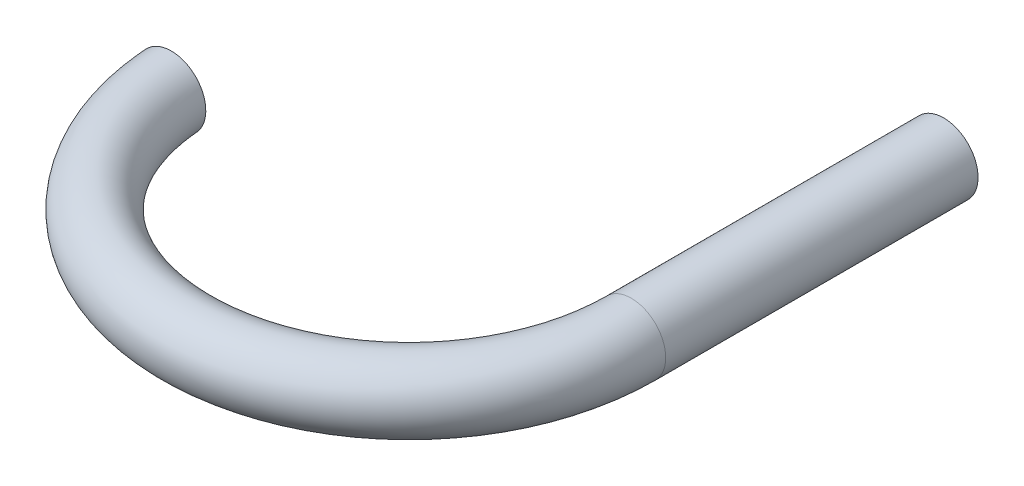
ISO-10303-21;
HEADER;
FILE_DESCRIPTION(('STEP AP214'),'2;1');
FILE_NAME('part.step','',(''),(''),'','','');
FILE_SCHEMA(('AUTOMOTIVE_DESIGN { 1 0 10303 214 1 1 1 1 }'));
ENDSEC;
DATA;
#1=APPLICATION_CONTEXT('core data for automotive mechanical design processes');
#2=APPLICATION_PROTOCOL_DEFINITION('international standard','automotive_design',2000,#1);
#3=PRODUCT_CONTEXT('',#1,'mechanical');
#4=PRODUCT('Part','Part','',(#3));
#5=PRODUCT_RELATED_PRODUCT_CATEGORY('part','',(#4));
#6=PRODUCT_DEFINITION_FORMATION('','',#4);
#7=PRODUCT_DEFINITION_CONTEXT('part definition',#1,'design');
#8=PRODUCT_DEFINITION('design','',#6,#7);
#9=PRODUCT_DEFINITION_SHAPE('','',#8);
#10=(LENGTH_UNIT() NAMED_UNIT(*) SI_UNIT(.MILLI.,.METRE.));
#11=(NAMED_UNIT(*) PLANE_ANGLE_UNIT() SI_UNIT($,.RADIAN.));
#12=(NAMED_UNIT(*) SI_UNIT($,.STERADIAN.) SOLID_ANGLE_UNIT());
#13=UNCERTAINTY_MEASURE_WITH_UNIT(LENGTH_MEASURE(1.E-05),#10,'distance_accuracy_value','');
#14=(GEOMETRIC_REPRESENTATION_CONTEXT(3) GLOBAL_UNCERTAINTY_ASSIGNED_CONTEXT((#13)) GLOBAL_UNIT_ASSIGNED_CONTEXT((#10,
#11,#12)) REPRESENTATION_CONTEXT('',''));
#15=CARTESIAN_POINT('',(0.,0.,0.));
#16=DIRECTION('',(0.,0.,1.));
#17=DIRECTION('',(1.,0.,0.));
#18=AXIS2_PLACEMENT_3D('',#15,#16,#17);
#19=CARTESIAN_POINT('',(-298.225813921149,72.1037781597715,15.));
#20=DIRECTION('',(0.,0.,-1.));
#21=DIRECTION('',(-1.,0.,0.));
#22=AXIS2_PLACEMENT_3D('',#19,#20,#21);
#23=PLANE('',#22);
#24=CARTESIAN_POINT('',(-232.153031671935,-23.3197501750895,15.));
#25=CARTESIAN_POINT('',(-232.808584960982,-22.6847204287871,15.));
#26=CARTESIAN_POINT('',(-233.437312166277,-22.02215820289,15.));
#27=CARTESIAN_POINT('',(-234.637011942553,-20.6462819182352,15.));
#28=CARTESIAN_POINT('',(-235.207969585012,-19.9329548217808,15.));
#29=CARTESIAN_POINT('',(-236.288393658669,-18.459983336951,15.));
#30=CARTESIAN_POINT('',(-236.797792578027,-17.7002894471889,15.));
#31=CARTESIAN_POINT('',(-237.750708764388,-16.1407115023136,15.));
#32=CARTESIAN_POINT('',(-238.194230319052,-15.340830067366,15.));
#33=CARTESIAN_POINT('',(-239.012085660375,-13.7068298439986,15.));
#34=CARTESIAN_POINT('',(-239.386445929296,-12.8727243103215,15.));
#35=CARTESIAN_POINT('',(-240.063506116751,-11.1759029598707,15.));
#36=CARTESIAN_POINT('',(-240.366204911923,-10.313186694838,15.));
#37=CARTESIAN_POINT('',(-240.89769071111,-8.56551662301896,15.));
#38=CARTESIAN_POINT('',(-241.126496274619,-7.68056846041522,15.));
#39=CARTESIAN_POINT('',(-241.50865307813,-5.89453085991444,15.));
#40=CARTESIAN_POINT('',(-241.662004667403,-4.99344149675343,15.));
#41=CARTESIAN_POINT('',(-241.892045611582,-3.18237161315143,15.));
#42=CARTESIAN_POINT('',(-241.968805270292,-2.27240002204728,15.));
#43=CARTESIAN_POINT('',(-242.045357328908,-0.449224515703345,15.));
#44=CARTESIAN_POINT('',(-242.045149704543,0.463979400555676,15.));
#45=CARTESIAN_POINT('',(-241.967767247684,2.28715141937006,15.));
#46=CARTESIAN_POINT('',(-241.890589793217,3.19711941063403,15.));
#47=CARTESIAN_POINT('',(-241.659818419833,5.0073131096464,15.));
#48=CARTESIAN_POINT('',(-241.506224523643,5.90753882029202,15.));
#49=CARTESIAN_POINT('',(-241.1238143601,7.69142271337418,15.));
#50=CARTESIAN_POINT('',(-240.895033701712,8.57508852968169,15.));
#51=CARTESIAN_POINT('',(-240.363871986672,10.3200150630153,15.));
#52=CARTESIAN_POINT('',(-240.061490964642,11.1812757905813,15.));
#53=CARTESIAN_POINT('',(-239.385296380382,12.8752812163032,15.));
#54=CARTESIAN_POINT('',(-239.011482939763,13.7080259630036,15.));
#55=CARTESIAN_POINT('',(-238.195099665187,15.3391012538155,15.));
#56=CARTESIAN_POINT('',(-237.752529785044,16.1374317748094,15.));
#57=CARTESIAN_POINT('',(-236.801491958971,17.6945326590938,15.));
#58=CARTESIAN_POINT('',(-236.292981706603,18.4532771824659,15.));
#59=CARTESIAN_POINT('',(-235.213921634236,19.9252867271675,15.));
#60=CARTESIAN_POINT('',(-234.643371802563,20.638551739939,15.));
#61=CARTESIAN_POINT('',(-233.4443044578,22.0145706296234,15.));
#62=CARTESIAN_POINT('',(-232.815786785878,22.6773243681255,15.));
#63=CARTESIAN_POINT('',(-231.505264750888,23.9476521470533,15.));
#64=CARTESIAN_POINT('',(-230.823260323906,24.5552261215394,15.));
#65=CARTESIAN_POINT('',(-229.40949604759,25.711843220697,15.));
#66=CARTESIAN_POINT('',(-228.677658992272,26.2607919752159,15.));
#67=CARTESIAN_POINT('',(-227.170410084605,27.2951942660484,15.));
#68=CARTESIAN_POINT('',(-226.394998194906,27.7806477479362,15.));
#69=CARTESIAN_POINT('',(-224.806106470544,28.6846612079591,15.));
#70=CARTESIAN_POINT('',(-223.992626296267,29.103220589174,15.));
#71=CARTESIAN_POINT('',(-222.333377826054,29.8705165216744,15.));
#72=CARTESIAN_POINT('',(-221.48760948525,30.2192529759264,15.));
#73=CARTESIAN_POINT('',(-219.76797021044,30.8451317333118,15.));
#74=CARTESIAN_POINT('',(-218.894043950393,31.1221220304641,15.));
#75=CARTESIAN_POINT('',(-217.12599142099,31.6016175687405,15.));
#76=CARTESIAN_POINT('',(-216.231865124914,31.8041227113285,15.));
#77=CARTESIAN_POINT('',(-214.429745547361,32.1332460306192,15.));
#78=CARTESIAN_POINT('',(-213.521752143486,32.2598635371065,15.));
#79=CARTESIAN_POINT('',(-211.698336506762,32.436339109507,15.));
#80=CARTESIAN_POINT('',(-210.782914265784,32.4861970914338,15.));
#81=CARTESIAN_POINT('',(-208.949359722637,32.5088424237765,15.));
#82=CARTESIAN_POINT('',(-208.031225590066,32.4814817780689,15.));
#83=CARTESIAN_POINT('',(-206.200517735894,32.3495789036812,15.));
#84=CARTESIAN_POINT('',(-205.287944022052,32.2450365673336,15.));
#85=CARTESIAN_POINT('',(-203.474826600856,31.9595155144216,15.));
#86=CARTESIAN_POINT('',(-202.574282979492,31.7785362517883,15.));
#87=CARTESIAN_POINT('',(-200.791624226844,31.3414210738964,15.));
#88=CARTESIAN_POINT('',(-199.90950909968,31.085285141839,15.));
#89=CARTESIAN_POINT('',(-198.169224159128,30.4994088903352,15.));
#90=CARTESIAN_POINT('',(-197.31107558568,30.1696054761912,15.));
#91=CARTESIAN_POINT('',(-195.625627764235,29.4388434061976,15.));
#92=CARTESIAN_POINT('',(-194.798328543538,29.0378846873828,15.));
#93=CARTESIAN_POINT('',(-193.180484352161,28.1676362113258,15.));
#94=CARTESIAN_POINT('',(-192.389939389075,27.6983464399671,15.));
#95=CARTESIAN_POINT('',(-190.851260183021,26.6947436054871,15.));
#96=CARTESIAN_POINT('',(-190.103125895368,26.1604306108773,15.));
#97=CARTESIAN_POINT('',(-188.65529623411,25.0310676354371,15.));
#98=CARTESIAN_POINT('',(-187.955557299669,24.4360735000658,15.));
#99=CARTESIAN_POINT('',(-186.608797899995,23.1891434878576,15.));
#100=CARTESIAN_POINT('',(-185.961777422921,22.537207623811,15.));
#101=CARTESIAN_POINT('',(-184.725127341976,21.1810131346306,15.));
#102=CARTESIAN_POINT('',(-184.13549721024,20.4767549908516,15.));
#103=CARTESIAN_POINT('',(-183.017891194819,19.0209079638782,15.));
#104=CARTESIAN_POINT('',(-182.489915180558,18.2693191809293,15.));
#105=CARTESIAN_POINT('',(-181.500773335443,16.7262160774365,15.));
#106=CARTESIAN_POINT('',(-181.039433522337,15.9348132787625,15.));
#107=CARTESIAN_POINT('',(-180.185247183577,14.3158681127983,15.));
#108=CARTESIAN_POINT('',(-179.792400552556,13.4883258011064,15.));
#109=CARTESIAN_POINT('',(-179.07806907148,11.8030080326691,15.));
#110=CARTESIAN_POINT('',(-178.756583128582,10.9452330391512,15.));
#111=CARTESIAN_POINT('',(-178.187316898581,9.20556429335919,15.));
#112=CARTESIAN_POINT('',(-177.939536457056,8.32367059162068,15.));
#113=CARTESIAN_POINT('',(-177.520173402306,6.54494286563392,15.));
#114=CARTESIAN_POINT('',(-177.34834842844,5.64816597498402,15.));
#115=CARTESIAN_POINT('',(-177.080990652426,3.84331135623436,15.));
#116=CARTESIAN_POINT('',(-176.985457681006,2.93523365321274,15.));
#117=CARTESIAN_POINT('',(-176.871383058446,1.11426536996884,15.));
#118=CARTESIAN_POINT('',(-176.852840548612,0.201374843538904,15.));
#119=CARTESIAN_POINT('',(-176.892880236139,-1.6227130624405,15.));
#120=CARTESIAN_POINT('',(-176.951462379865,-2.533910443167,15.));
#121=CARTESIAN_POINT('',(-177.145142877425,-4.34642981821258,15.));
#122=CARTESIAN_POINT('',(-177.28009951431,-5.24776696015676,15.));
#123=CARTESIAN_POINT('',(-177.625441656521,-7.03587155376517,15.));
#124=CARTESIAN_POINT('',(-177.835827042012,-7.92263902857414,15.));
#125=CARTESIAN_POINT('',(-178.330497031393,-9.6753142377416,15.));
#126=CARTESIAN_POINT('',(-178.614781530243,-10.5412220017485,15.));
#127=CARTESIAN_POINT('',(-179.255188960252,-12.246051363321,15.));
#128=CARTESIAN_POINT('',(-179.611311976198,-13.0849729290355,15.));
#129=CARTESIAN_POINT('',(-180.393116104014,-14.7305243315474,15.));
#130=CARTESIAN_POINT('',(-180.81884921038,-15.5371294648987,15.));
#131=CARTESIAN_POINT('',(-181.736613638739,-17.1116943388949,15.));
#132=CARTESIAN_POINT('',(-182.228644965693,-17.8796540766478,15.));
#133=CARTESIAN_POINT('',(-183.27547769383,-19.3715399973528,15.));
#134=CARTESIAN_POINT('',(-183.830279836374,-20.0954656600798,15.));
#135=CARTESIAN_POINT('',(-184.998680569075,-21.4942021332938,15.));
#136=CARTESIAN_POINT('',(-185.612279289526,-22.169012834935,15.));
#137=CARTESIAN_POINT('',(-186.895714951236,-23.466638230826,15.));
#138=CARTESIAN_POINT('',(-187.565706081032,-24.0893004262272,15.));
#139=CARTESIAN_POINT('',(-188.95563780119,-25.2761259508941,15.));
#140=CARTESIAN_POINT('',(-189.675578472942,-25.8402891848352,15.));
#141=CARTESIAN_POINT('',(-191.160298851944,-26.9061800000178,15.));
#142=CARTESIAN_POINT('',(-191.925079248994,-27.4079066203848,15.));
#143=CARTESIAN_POINT('',(-193.494045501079,-28.3454120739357,15.));
#144=CARTESIAN_POINT('',(-194.298231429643,-28.7811907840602,15.));
#145=CARTESIAN_POINT('',(-195.942897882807,-29.5850203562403,15.));
#146=CARTESIAN_POINT('',(-196.783484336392,-29.9528544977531,15.));
#147=CARTESIAN_POINT('',(-198.492616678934,-30.616520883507,15.));
#148=CARTESIAN_POINT('',(-199.361162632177,-30.9123529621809,15.));
#149=CARTESIAN_POINT('',(-201.120028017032,-31.4299297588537,15.));
#150=CARTESIAN_POINT('',(-202.010346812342,-31.6516766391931,15.));
#151=CARTESIAN_POINT('',(-203.806474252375,-32.0195339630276,15.));
#152=CARTESIAN_POINT('',(-204.712282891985,-32.1656444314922,15.));
#153=CARTESIAN_POINT('',(-206.534501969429,-32.3813753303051,15.));
#154=CARTESIAN_POINT('',(-207.450927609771,-32.4508673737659,15.));
#155=CARTESIAN_POINT('',(-209.286380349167,-32.512421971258,15.));
#156=CARTESIAN_POINT('',(-210.205407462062,-32.5044841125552,15.));
#157=CARTESIAN_POINT('',(-212.039762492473,-32.4112059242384,15.));
#158=CARTESIAN_POINT('',(-212.955089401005,-32.3258457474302,15.));
#159=CARTESIAN_POINT('',(-214.775276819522,-32.0782812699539,15.));
#160=CARTESIAN_POINT('',(-215.680137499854,-31.9160782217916,15.));
#161=CARTESIAN_POINT('',(-217.473275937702,-31.515883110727,15.));
#162=CARTESIAN_POINT('',(-218.361547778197,-31.277864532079,15.));
#163=CARTESIAN_POINT('',(-220.114894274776,-30.7277040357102,15.));
#164=CARTESIAN_POINT('',(-220.979967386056,-30.415557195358,15.));
#165=CARTESIAN_POINT('',(-222.679738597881,-29.7197150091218,15.));
#166=CARTESIAN_POINT('',(-223.514469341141,-29.3360994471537,15.));
#167=CARTESIAN_POINT('',(-225.148322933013,-28.4999472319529,15.));
#168=CARTESIAN_POINT('',(-225.947455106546,-28.0474287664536,15.));
#169=CARTESIAN_POINT('',(-227.702068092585,-26.9534492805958,15.));
#170=CARTESIAN_POINT('',(-228.645885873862,-26.2931619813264,15.));
#171=CARTESIAN_POINT('',(-230.458344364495,-24.8764050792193,15.));
#172=CARTESIAN_POINT('',(-231.326985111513,-24.1199355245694,15.));
#173=CARTESIAN_POINT('',(-232.153031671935,-23.3197501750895,15.));
#174=B_SPLINE_CURVE_WITH_KNOTS('',3,(#24,#25,#26,#27,#28,#29,#30,#31,#32,#33,#34,#35,#36,#37,
#38,#39,#40,#41,#42,#43,#44,#45,#46,#47,#48,#49,#50,#51,#52,#53,#54,#55,#56,#57,#58,#59,#60,#61,
#62,#63,#64,#65,#66,#67,#68,#69,#70,#71,#72,#73,#74,#75,#76,#77,#78,#79,#80,#81,#82,#83,#84,#85,
#86,#87,#88,#89,#90,#91,#92,#93,#94,#95,#96,#97,#98,#99,#100,#101,#102,#103,#104,#105,#106,#107,
#108,#109,#110,#111,#112,#113,#114,#115,#116,#117,#118,#119,#120,#121,#122,#123,#124,#125,#126,
#127,#128,#129,#130,#131,#132,#133,#134,#135,#136,#137,#138,#139,#140,#141,#142,#143,#144,#145,
#146,#147,#148,#149,#150,#151,#152,#153,#154,#155,#156,#157,#158,#159,#160,#161,#162,#163,#164,
#165,#166,#167,#168,#169,#170,#171,#172,#173),.UNSPECIFIED.,.T.,.F.,(4,2,2,2,2,2,2,2,2,2,2,2,2,
2,2,2,2,2,2,2,2,2,2,2,2,2,2,2,2,2,2,2,2,2,2,2,2,2,2,2,2,2,2,2,2,2,2,2,2,2,2,2,2,2,2,2,2,2,2,2,2,
2,2,2,2,2,2,2,2,2,2,2,2,2,4),(0.,2.73708491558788,5.47487533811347,8.21564157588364,
10.9562293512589,13.6957655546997,16.4353447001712,19.1742352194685,21.9131130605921,
24.6494745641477,27.3858369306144,30.1222925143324,32.8587472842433,35.5939079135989,
38.329067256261,41.0642219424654,43.7993784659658,46.5362985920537,49.2732192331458,
52.010147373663,54.7470787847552,57.4883515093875,60.2296265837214,62.9709261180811,
65.7122294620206,68.4592940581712,71.206362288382,73.9534547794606,76.7005502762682,
79.4529143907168,82.2052823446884,84.9576699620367,87.7100581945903,90.4648128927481,
93.2195700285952,95.9743277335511,98.7290825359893,101.481324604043,104.23356605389,
106.985782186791,109.737992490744,112.482881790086,115.227766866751,117.972609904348,
120.71744719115,123.453461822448,126.189470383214,128.925448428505,131.661424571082,
134.39234053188,137.123252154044,139.854159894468,142.585070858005,145.318031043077,
148.050991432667,150.783984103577,153.516982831,156.25771328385,158.99844820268,
161.739225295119,164.480007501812,167.229386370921,169.978771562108,172.728076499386,
175.477380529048,178.231284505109,180.985203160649,183.739827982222,186.494407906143,
189.249952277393,192.005679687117,194.758348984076,197.510292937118,200.95922798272,
204.408161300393),.UNSPECIFIED.);
#175=CARTESIAN_POINT('',(-232.153031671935,-23.3197501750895,15.));
#176=VERTEX_POINT('',#175);
#177=EDGE_CURVE('E41',#176,#176,#174,.T.);
#178=ORIENTED_EDGE('',*,*,#177,.T.);
#179=EDGE_LOOP('',(#178));
#180=FACE_BOUND('',#179,.T.);
#181=CARTESIAN_POINT('',(-209.45035969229,-0.000728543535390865,15.));
#182=DIRECTION('',(0.,0.,-1.));
#183=DIRECTION('',(-1.,0.,0.));
#184=AXIS2_PLACEMENT_3D('',#181,#182,#183);
#185=CIRCLE('',#184,27.5);
#186=CARTESIAN_POINT('',(-236.95035969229,-0.000728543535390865,15.));
#187=VERTEX_POINT('',#186);
#188=EDGE_CURVE('E57',#187,#187,#185,.T.);
#189=ORIENTED_EDGE('',*,*,#188,.F.);
#190=EDGE_LOOP('',(#189));
#191=FACE_BOUND('',#190,.T.);
#192=ADVANCED_FACE('F36',(#180,#191),#23,.T.);
#193=CARTESIAN_POINT('',(0.,0.,0.));
#194=DIRECTION('',(0.,-1.,0.));
#195=DIRECTION('',(0.,0.,-1.));
#196=AXIS2_PLACEMENT_3D('',#193,#194,#195);
#197=TOROIDAL_SURFACE('',#196,210.,32.5);
#198=CARTESIAN_POINT('',(210.,0.,-2.95856275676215E-12));
#199=DIRECTION('',(0.,0.,-1.));
#200=DIRECTION('',(-1.,0.,0.));
#201=AXIS2_PLACEMENT_3D('',#198,#199,#200);
#202=CIRCLE('',#201,32.5);
#203=CARTESIAN_POINT('',(177.5,0.,-2.50068994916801E-12));
#204=VERTEX_POINT('',#203);
#205=EDGE_CURVE('E10',#204,#204,#202,.T.);
#206=ORIENTED_EDGE('',*,*,#205,.F.);
#207=EDGE_LOOP('',(#206));
#208=FACE_BOUND('',#207,.T.);
#209=ORIENTED_EDGE('',*,*,#177,.F.);
#210=EDGE_LOOP('',(#209));
#211=FACE_BOUND('',#210,.T.);
#212=ADVANCED_FACE('F38',(#208,#211),#197,.T.);
#213=CARTESIAN_POINT('',(209.999999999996,0.,-295.));
#214=DIRECTION('',(0.,0.,1.));
#215=DIRECTION('',(1.,0.,0.));
#216=AXIS2_PLACEMENT_3D('',#213,#214,#215);
#217=CYLINDRICAL_SURFACE('',#216,32.5);
#218=CARTESIAN_POINT('',(209.999999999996,0.,-295.));
#219=DIRECTION('',(0.,0.,-1.));
#220=DIRECTION('',(-1.,0.,0.));
#221=AXIS2_PLACEMENT_3D('',#218,#219,#220);
#222=CIRCLE('',#221,32.5);
#223=CARTESIAN_POINT('',(177.499999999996,0.,-295.));
#224=VERTEX_POINT('',#223);
#225=EDGE_CURVE('E49',#224,#224,#222,.T.);
#226=ORIENTED_EDGE('',*,*,#225,.F.);
#227=EDGE_LOOP('',(#226));
#228=FACE_BOUND('',#227,.T.);
#229=ORIENTED_EDGE('',*,*,#205,.T.);
#230=EDGE_LOOP('',(#229));
#231=FACE_BOUND('',#230,.T.);
#232=ADVANCED_FACE('F72',(#228,#231),#217,.T.);
#233=CARTESIAN_POINT('',(209.999999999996,0.,-295.));
#234=DIRECTION('',(0.,0.,-1.));
#235=DIRECTION('',(-1.,0.,0.));
#236=AXIS2_PLACEMENT_3D('',#233,#234,#235);
#237=PLANE('',#236);
#238=ORIENTED_EDGE('',*,*,#225,.T.);
#239=EDGE_LOOP('',(#238));
#240=FACE_BOUND('',#239,.T.);
#241=ADVANCED_FACE('F78',(#240),#237,.T.);
#242=CARTESIAN_POINT('',(-209.45035969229,-0.000728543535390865,12.));
#243=DIRECTION('',(0.,0.,1.));
#244=DIRECTION('',(1.,0.,0.));
#245=AXIS2_PLACEMENT_3D('',#242,#243,#244);
#246=CYLINDRICAL_SURFACE('',#245,27.5);
#247=CARTESIAN_POINT('',(-209.45035969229,-0.000728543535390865,12.));
#248=DIRECTION('',(0.,0.,-1.));
#249=DIRECTION('',(-1.,0.,0.));
#250=AXIS2_PLACEMENT_3D('',#247,#248,#249);
#251=CIRCLE('',#250,27.5);
#252=CARTESIAN_POINT('',(-236.95035969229,-0.000728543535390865,12.));
#253=VERTEX_POINT('',#252);
#254=EDGE_CURVE('E61',#253,#253,#251,.T.);
#255=ORIENTED_EDGE('',*,*,#254,.F.);
#256=EDGE_LOOP('',(#255));
#257=FACE_BOUND('',#256,.T.);
#258=ORIENTED_EDGE('',*,*,#188,.T.);
#259=EDGE_LOOP('',(#258));
#260=FACE_BOUND('',#259,.T.);
#261=ADVANCED_FACE('F85',(#257,#260),#246,.T.);
#262=CARTESIAN_POINT('',(-209.45035969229,-0.000728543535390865,12.));
#263=DIRECTION('',(0.,0.,-1.));
#264=DIRECTION('',(-1.,0.,0.));
#265=AXIS2_PLACEMENT_3D('',#262,#263,#264);
#266=PLANE('',#265);
#267=ORIENTED_EDGE('',*,*,#254,.T.);
#268=EDGE_LOOP('',(#267));
#269=FACE_BOUND('',#268,.T.);
#270=ADVANCED_FACE('F92',(#269),#266,.T.);
#271=CLOSED_SHELL('',(#192,#212,#232,#241,#261,#270));
#272=MANIFOLD_SOLID_BREP('B2',#271);
#273=ADVANCED_BREP_SHAPE_REPRESENTATION('',(#18,#272),#14);
#274=SHAPE_DEFINITION_REPRESENTATION(#9,#273);
ENDSEC;
END-ISO-10303-21;
